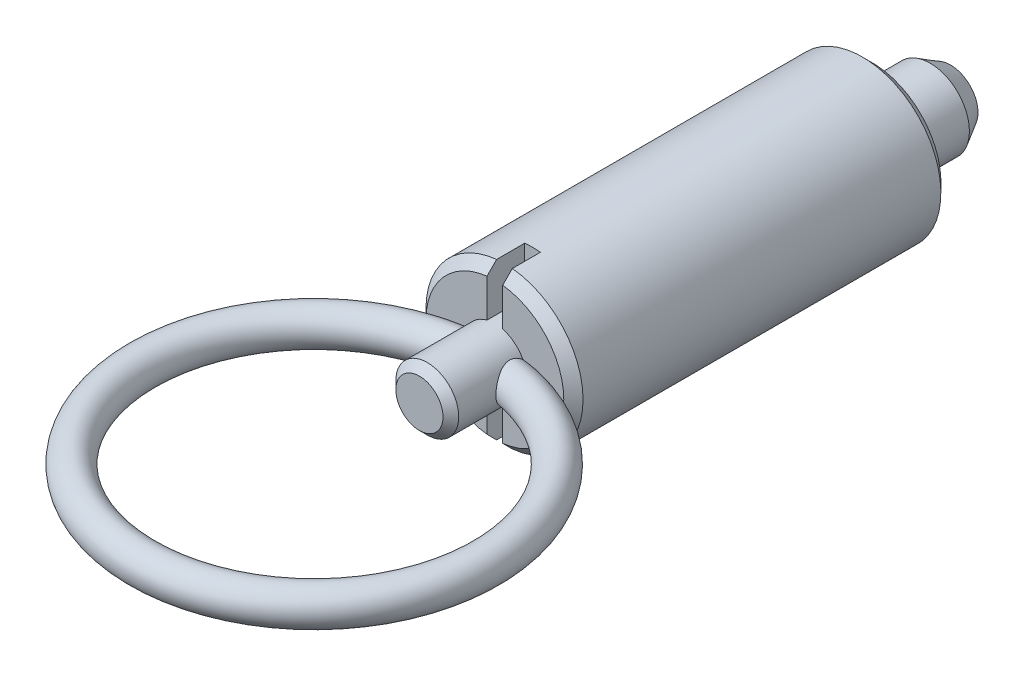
ISO-10303-21;
HEADER;
FILE_DESCRIPTION(('STEP AP214'),'2;1');
FILE_NAME('part.step','',(''),(''),'','','');
FILE_SCHEMA(('AUTOMOTIVE_DESIGN { 1 0 10303 214 1 1 1 1 }'));
ENDSEC;
DATA;
#1=APPLICATION_CONTEXT('core data for automotive mechanical design processes');
#2=APPLICATION_PROTOCOL_DEFINITION('international standard','automotive_design',2000,#1);
#3=PRODUCT_CONTEXT('',#1,'mechanical');
#4=PRODUCT('Part','Part','',(#3));
#5=PRODUCT_RELATED_PRODUCT_CATEGORY('part','',(#4));
#6=PRODUCT_DEFINITION_FORMATION('','',#4);
#7=PRODUCT_DEFINITION_CONTEXT('part definition',#1,'design');
#8=PRODUCT_DEFINITION('design','',#6,#7);
#9=PRODUCT_DEFINITION_SHAPE('','',#8);
#10=(LENGTH_UNIT() NAMED_UNIT(*) SI_UNIT(.MILLI.,.METRE.));
#11=(NAMED_UNIT(*) PLANE_ANGLE_UNIT() SI_UNIT($,.RADIAN.));
#12=(NAMED_UNIT(*) SI_UNIT($,.STERADIAN.) SOLID_ANGLE_UNIT());
#13=UNCERTAINTY_MEASURE_WITH_UNIT(LENGTH_MEASURE(1.E-05),#10,'distance_accuracy_value','');
#14=(GEOMETRIC_REPRESENTATION_CONTEXT(3) GLOBAL_UNCERTAINTY_ASSIGNED_CONTEXT((#13)) GLOBAL_UNIT_ASSIGNED_CONTEXT((#10,
#11,#12)) REPRESENTATION_CONTEXT('',''));
#15=CARTESIAN_POINT('',(0.,0.,0.));
#16=DIRECTION('',(0.,0.,1.));
#17=DIRECTION('',(1.,0.,0.));
#18=AXIS2_PLACEMENT_3D('',#15,#16,#17);
#19=CARTESIAN_POINT('',(1.74944465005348,0.,-5.));
#20=DIRECTION('',(0.,0.,1.));
#21=DIRECTION('',(0.,-1.,0.));
#22=AXIS2_PLACEMENT_3D('',#19,#20,#21);
#23=PLANE('',#22);
#24=CARTESIAN_POINT('',(0.,0.,-5.0000000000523));
#25=DIRECTION('',(0.,0.,1.));
#26=DIRECTION('',(0.,-1.,0.));
#27=AXIS2_PLACEMENT_3D('',#24,#25,#26);
#28=CIRCLE('',#27,1.74944465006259);
#29=CARTESIAN_POINT('',(0.,-1.74944465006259,-5.0000000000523));
#30=VERTEX_POINT('',#29);
#31=EDGE_CURVE('E17',#30,#30,#28,.T.);
#32=ORIENTED_EDGE('',*,*,#31,.F.);
#33=EDGE_LOOP('',(#32));
#34=FACE_BOUND('',#33,.T.);
#35=ADVANCED_FACE('F14',(#34),#23,.F.);
#36=CARTESIAN_POINT('',(0.,0.,-3.70000000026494));
#37=DIRECTION('',(0.,0.,1.));
#38=DIRECTION('',(0.,-1.,0.));
#39=AXIS2_PLACEMENT_3D('',#36,#37,#38);
#40=CONICAL_SURFACE('',#39,2.49999999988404,0.523598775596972);
#41=CARTESIAN_POINT('',(0.,0.,-3.7));
#42=DIRECTION('',(0.,0.,1.));
#43=DIRECTION('',(0.,-1.,0.));
#44=AXIS2_PLACEMENT_3D('',#41,#42,#43);
#45=CIRCLE('',#44,2.5);
#46=CARTESIAN_POINT('',(0.,-2.5,-3.7));
#47=VERTEX_POINT('',#46);
#48=EDGE_CURVE('E174',#47,#47,#45,.T.);
#49=ORIENTED_EDGE('',*,*,#48,.F.);
#50=EDGE_LOOP('',(#49));
#51=FACE_BOUND('',#50,.T.);
#52=ORIENTED_EDGE('',*,*,#31,.T.);
#53=EDGE_LOOP('',(#52));
#54=FACE_BOUND('',#53,.T.);
#55=ADVANCED_FACE('F309',(#51,#54),#40,.T.);
#56=CARTESIAN_POINT('',(0.,0.,-5.));
#57=DIRECTION('',(0.,0.,1.));
#58=DIRECTION('',(0.,-1.,0.));
#59=AXIS2_PLACEMENT_3D('',#56,#57,#58);
#60=CYLINDRICAL_SURFACE('',#59,2.5);
#61=CARTESIAN_POINT('',(0.,0.,0.));
#62=DIRECTION('',(0.,0.,1.));
#63=DIRECTION('',(0.,-1.,0.));
#64=AXIS2_PLACEMENT_3D('',#61,#62,#63);
#65=CIRCLE('',#64,2.5);
#66=CARTESIAN_POINT('',(0.,-2.5,0.));
#67=VERTEX_POINT('',#66);
#68=EDGE_CURVE('E177',#67,#67,#65,.F.);
#69=ORIENTED_EDGE('',*,*,#68,.T.);
#70=EDGE_LOOP('',(#69));
#71=FACE_BOUND('',#70,.T.);
#72=ORIENTED_EDGE('',*,*,#48,.T.);
#73=EDGE_LOOP('',(#72));
#74=FACE_BOUND('',#73,.T.);
#75=ADVANCED_FACE('F306',(#71,#74),#60,.T.);
#76=CARTESIAN_POINT('',(4.3865,0.,0.));
#77=DIRECTION('',(0.,0.,1.));
#78=DIRECTION('',(0.,-1.,0.));
#79=AXIS2_PLACEMENT_3D('',#76,#77,#78);
#80=PLANE('',#79);
#81=CARTESIAN_POINT('',(0.,0.,-5.6843418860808E-11));
#82=DIRECTION('',(0.,0.,1.));
#83=DIRECTION('',(0.,-1.,0.));
#84=AXIS2_PLACEMENT_3D('',#81,#82,#83);
#85=CIRCLE('',#84,4.38649999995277);
#86=CARTESIAN_POINT('',(0.,-4.38649999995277,-5.6843418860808E-11));
#87=VERTEX_POINT('',#86);
#88=EDGE_CURVE('E171',#87,#87,#85,.T.);
#89=ORIENTED_EDGE('',*,*,#88,.F.);
#90=EDGE_LOOP('',(#89));
#91=FACE_BOUND('',#90,.T.);
#92=ORIENTED_EDGE('',*,*,#68,.F.);
#93=EDGE_LOOP('',(#92));
#94=FACE_BOUND('',#93,.T.);
#95=ADVANCED_FACE('F302',(#91,#94),#80,.F.);
#96=CARTESIAN_POINT('',(0.,0.,0.61349999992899));
#97=DIRECTION('',(0.,0.,1.));
#98=DIRECTION('',(0.,-1.,0.));
#99=AXIS2_PLACEMENT_3D('',#96,#97,#98);
#100=CONICAL_SURFACE('',#99,4.99999999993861,0.785398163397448);
#101=CARTESIAN_POINT('',(0.,0.,0.6135));
#102=DIRECTION('',(0.,0.,1.));
#103=DIRECTION('',(0.,-1.,0.));
#104=AXIS2_PLACEMENT_3D('',#101,#102,#103);
#105=CIRCLE('',#104,5.);
#106=CARTESIAN_POINT('',(0.,-5.,0.6135));
#107=VERTEX_POINT('',#106);
#108=EDGE_CURVE('E109',#107,#107,#105,.T.);
#109=ORIENTED_EDGE('',*,*,#108,.F.);
#110=EDGE_LOOP('',(#109));
#111=FACE_BOUND('',#110,.T.);
#112=ORIENTED_EDGE('',*,*,#88,.T.);
#113=EDGE_LOOP('',(#112));
#114=FACE_BOUND('',#113,.T.);
#115=ADVANCED_FACE('F298',(#111,#114),#100,.T.);
#116=CARTESIAN_POINT('',(0.,0.,28.8));
#117=DIRECTION('',(0.,0.,-1.));
#118=DIRECTION('',(0.,1.,0.));
#119=AXIS2_PLACEMENT_3D('',#116,#117,#118);
#120=PLANE('',#119);
#121=CARTESIAN_POINT('',(0.,0.,28.8000000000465));
#122=DIRECTION('',(0.,0.,-1.));
#123=DIRECTION('',(0.,1.,0.));
#124=AXIS2_PLACEMENT_3D('',#121,#122,#123);
#125=CIRCLE('',#124,1.50000000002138);
#126=CARTESIAN_POINT('',(0.,1.50000000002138,28.8000000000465));
#127=VERTEX_POINT('',#126);
#128=EDGE_CURVE('E119',#127,#127,#125,.T.);
#129=ORIENTED_EDGE('',*,*,#128,.F.);
#130=EDGE_LOOP('',(#129));
#131=FACE_BOUND('',#130,.T.);
#132=ADVANCED_FACE('F258',(#131),#120,.F.);
#133=CARTESIAN_POINT('',(0.,0.,28.3000000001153));
#134=DIRECTION('',(0.,0.,-1.));
#135=DIRECTION('',(0.,1.,0.));
#136=AXIS2_PLACEMENT_3D('',#133,#134,#135);
#137=CONICAL_SURFACE('',#136,1.9999999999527,0.785398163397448);
#138=ORIENTED_EDGE('',*,*,#128,.T.);
#139=EDGE_LOOP('',(#138));
#140=FACE_BOUND('',#139,.T.);
#141=CARTESIAN_POINT('',(0.,0.,28.3));
#142=DIRECTION('',(0.,0.,1.));
#143=DIRECTION('',(0.,-1.,0.));
#144=AXIS2_PLACEMENT_3D('',#141,#142,#143);
#145=CIRCLE('',#144,2.);
#146=CARTESIAN_POINT('',(0.,-2.,28.3));
#147=VERTEX_POINT('',#146);
#148=EDGE_CURVE('E137',#147,#147,#145,.F.);
#149=ORIENTED_EDGE('',*,*,#148,.F.);
#150=EDGE_LOOP('',(#149));
#151=FACE_BOUND('',#150,.T.);
#152=ADVANCED_FACE('F255',(#140,#151),#137,.T.);
#153=CARTESIAN_POINT('',(0.,0.,35.5));
#154=DIRECTION('',(0.,-1.,0.));
#155=DIRECTION('',(1.,0.,0.));
#156=AXIS2_PLACEMENT_3D('',#153,#154,#155);
#157=TOROIDAL_SURFACE('',#156,10.925,1.15);
#158=CARTESIAN_POINT('',(1.78476912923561,0.902551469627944,24.));
#159=CARTESIAN_POINT('',(1.766631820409,0.938435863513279,24.0431175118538));
#160=CARTESIAN_POINT('',(1.74879786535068,0.970988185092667,24.0892748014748));
#161=CARTESIAN_POINT('',(1.71545124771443,1.02875631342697,24.1870412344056));
#162=CARTESIAN_POINT('',(1.69995018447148,1.05393601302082,24.238675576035));
#163=CARTESIAN_POINT('',(1.67313310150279,1.0960196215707,24.3465793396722));
#164=CARTESIAN_POINT('',(1.66183629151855,1.11288565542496,24.4028686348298));
#165=CARTESIAN_POINT('',(1.6451157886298,1.13746273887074,24.5180886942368));
#166=CARTESIAN_POINT('',(1.63967356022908,1.14520268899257,24.5770105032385));
#167=CARTESIAN_POINT('',(1.6354310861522,1.15124898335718,24.6905839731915));
#168=CARTESIAN_POINT('',(1.63611280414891,1.15029102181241,24.7451800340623));
#169=CARTESIAN_POINT('',(1.64254496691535,1.14108481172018,24.8534961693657));
#170=CARTESIAN_POINT('',(1.64830354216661,1.13282486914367,24.9072146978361));
#171=CARTESIAN_POINT('',(1.6660547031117,1.10660417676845,25.02645972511));
#172=CARTESIAN_POINT('',(1.67929154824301,1.08665838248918,25.0913604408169));
#173=CARTESIAN_POINT('',(1.71010159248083,1.03749182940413,25.2164292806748));
#174=CARTESIAN_POINT('',(1.72768068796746,1.0082584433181,25.2765908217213));
#175=CARTESIAN_POINT('',(1.76527077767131,0.940918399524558,25.3922228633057));
#176=CARTESIAN_POINT('',(1.78531454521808,0.90268416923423,25.4476086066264));
#177=CARTESIAN_POINT('',(1.81550576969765,0.839337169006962,25.5256509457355));
#178=CARTESIAN_POINT('',(1.8255886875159,0.817226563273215,25.5508217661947));
#179=CARTESIAN_POINT('',(1.84558579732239,0.771004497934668,25.5993988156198));
#180=CARTESIAN_POINT('',(1.8554997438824,0.746890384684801,25.6228026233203));
#181=CARTESIAN_POINT('',(1.88307268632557,0.675637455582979,25.6864889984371));
#182=CARTESIAN_POINT('',(1.90024401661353,0.626169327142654,25.7244404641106));
#183=CARTESIAN_POINT('',(1.93167740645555,0.521165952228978,25.7922035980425));
#184=CARTESIAN_POINT('',(1.94594447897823,0.465641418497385,25.8220293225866));
#185=CARTESIAN_POINT('',(1.96810100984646,0.359190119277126,25.8676868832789));
#186=CARTESIAN_POINT('',(1.97665879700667,0.309054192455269,25.8850267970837));
#187=CARTESIAN_POINT('',(1.99000988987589,0.206251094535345,25.911910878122));
#188=CARTESIAN_POINT('',(1.99480604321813,0.153585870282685,25.9214609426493));
#189=CARTESIAN_POINT('',(2.0001616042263,0.0469970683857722,25.9321177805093));
#190=CARTESIAN_POINT('',(2.00070650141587,-0.00693018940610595,25.9331956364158));
#191=CARTESIAN_POINT('',(1.99746095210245,-0.114135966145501,25.9267458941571));
#192=CARTESIAN_POINT('',(1.99366974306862,-0.167414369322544,25.919216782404));
#193=CARTESIAN_POINT('',(1.98244855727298,-0.269037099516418,25.8967096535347));
#194=CARTESIAN_POINT('',(1.97521507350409,-0.317494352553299,25.8821332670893));
#195=CARTESIAN_POINT('',(1.95779777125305,-0.411484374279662,25.8465284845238));
#196=CARTESIAN_POINT('',(1.94760839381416,-0.457011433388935,25.8254879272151));
#197=CARTESIAN_POINT('',(1.92368482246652,-0.549525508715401,25.7750835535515));
#198=CARTESIAN_POINT('',(1.90967618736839,-0.596066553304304,25.7450363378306));
#199=CARTESIAN_POINT('',(1.87992172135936,-0.684147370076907,25.6791690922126));
#200=CARTESIAN_POINT('',(1.86417667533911,-0.725689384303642,25.6433516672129));
#201=CARTESIAN_POINT('',(1.82848395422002,-0.811951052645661,25.5585671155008));
#202=CARTESIAN_POINT('',(1.80835814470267,-0.855447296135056,25.5084263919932));
#203=CARTESIAN_POINT('',(1.76880091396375,-0.934506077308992,25.4018843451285));
#204=CARTESIAN_POINT('',(1.74937088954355,-0.970053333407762,25.3454712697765));
#205=CARTESIAN_POINT('',(1.71070743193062,-1.03690546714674,25.2188541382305));
#206=CARTESIAN_POINT('',(1.69187881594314,-1.06692859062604,25.1478238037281));
#207=CARTESIAN_POINT('',(1.66889688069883,-1.10226136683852,25.0372460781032));
#208=CARTESIAN_POINT('',(1.66211623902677,-1.11241791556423,24.9997449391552));
#209=CARTESIAN_POINT('',(1.65071524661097,-1.1292661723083,24.9236611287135));
#210=CARTESIAN_POINT('',(1.64609361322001,-1.13595993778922,24.8850791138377));
#211=CARTESIAN_POINT('',(1.63811547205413,-1.14745411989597,24.7924559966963));
#212=CARTESIAN_POINT('',(1.63589923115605,-1.1505799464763,24.7380889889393));
#213=CARTESIAN_POINT('',(1.63683877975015,-1.14924307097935,24.6295426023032));
#214=CARTESIAN_POINT('',(1.63998868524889,-1.1447886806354,24.5753630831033));
#215=CARTESIAN_POINT('',(1.65141528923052,-1.1282401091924,24.4687753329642));
#216=CARTESIAN_POINT('',(1.65968967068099,-1.11614938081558,24.4163663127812));
#217=CARTESIAN_POINT('',(1.68043360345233,-1.08466330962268,24.3145828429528));
#218=CARTESIAN_POINT('',(1.69291081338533,-1.06525462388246,24.2652141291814));
#219=CARTESIAN_POINT('',(1.71839402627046,-1.02352974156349,24.1784427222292));
#220=CARTESIAN_POINT('',(1.7309688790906,-1.00223011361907,24.1404136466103));
#221=CARTESIAN_POINT('',(1.75722842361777,-0.955441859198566,24.0676896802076));
#222=CARTESIAN_POINT('',(1.77090804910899,-0.929971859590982,24.0329810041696));
#223=CARTESIAN_POINT('',(1.78476912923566,-0.902551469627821,24.));
#224=B_SPLINE_CURVE_WITH_KNOTS('',3,(#158,#159,#160,#161,#162,#163,#164,#165,#166,#167,#168,
#169,#170,#171,#172,#173,#174,#175,#176,#177,#178,#179,#180,#181,#182,#183,#184,#185,#186,#187,
#188,#189,#190,#191,#192,#193,#194,#195,#196,#197,#198,#199,#200,#201,#202,#203,#204,#205,#206,
#207,#208,#209,#210,#211,#212,#213,#214,#215,#216,#217,#218,#219,#220,#221,#222,#223),
.UNSPECIFIED.,.F.,.F.,(4,2,2,2,2,2,2,2,2,2,2,2,2,2,2,2,2,2,2,2,2,2,2,2,2,2,2,2,2,2,2,2,4),(0.,
0.176862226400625,0.354576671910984,0.533093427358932,0.711043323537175,0.874091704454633,
1.03740167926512,1.24381681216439,1.45051379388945,1.66033841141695,1.76521449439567,
1.87023177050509,2.06344264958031,2.25631715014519,2.41684175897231,2.5772447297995,
2.73819495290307,2.89917348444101,3.05189993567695,3.20491549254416,3.37572641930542,
3.5464604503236,3.75374287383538,3.96142042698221,4.19804235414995,4.31617322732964,
4.43423383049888,4.59696329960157,4.75951445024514,4.92199215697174,5.08476755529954,
5.22053797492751,5.35571774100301),.UNSPECIFIED.);
#225=CARTESIAN_POINT('',(1.78476912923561,0.902551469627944,24.));
#226=VERTEX_POINT('',#225);
#227=CARTESIAN_POINT('',(1.7847691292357,-0.902551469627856,24.));
#228=VERTEX_POINT('',#227);
#229=EDGE_CURVE('E23',#226,#228,#224,.T.);
#230=ORIENTED_EDGE('',*,*,#229,.T.);
#231=CARTESIAN_POINT('',(1.78476912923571,-0.902551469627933,24.));
#232=CARTESIAN_POINT('',(1.83794840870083,-0.896107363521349,24.));
#233=CARTESIAN_POINT('',(1.89107637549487,-0.889217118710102,24.));
#234=CARTESIAN_POINT('',(1.99726292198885,-0.874402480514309,24.));
#235=CARTESIAN_POINT('',(2.05032130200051,-0.866476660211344,24.));
#236=CARTESIAN_POINT('',(2.15628126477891,-0.849461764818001,24.));
#237=CARTESIAN_POINT('',(2.20918275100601,-0.840372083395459,24.));
#238=CARTESIAN_POINT('',(2.3152791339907,-0.820765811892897,24.));
#239=CARTESIAN_POINT('',(2.3684715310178,-0.810235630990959,24.0000000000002));
#240=CARTESIAN_POINT('',(2.47450459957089,-0.78761595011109,23.9999999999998));
#241=CARTESIAN_POINT('',(2.5273454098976,-0.775527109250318,23.9999999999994));
#242=CARTESIAN_POINT('',(2.63255461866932,-0.749524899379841,24.0000000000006));
#243=CARTESIAN_POINT('',(2.6849231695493,-0.735612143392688,24.0000000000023));
#244=CARTESIAN_POINT('',(2.81840562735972,-0.697188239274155,24.0000000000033));
#245=CARTESIAN_POINT('',(2.89909364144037,-0.671121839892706,24.0000000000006));
#246=CARTESIAN_POINT('',(3.01811329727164,-0.626713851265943,23.9999999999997));
#247=CARTESIAN_POINT('',(3.05743687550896,-0.611033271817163,23.9999999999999));
#248=CARTESIAN_POINT('',(3.13516069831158,-0.577558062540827,24.0000000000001));
#249=CARTESIAN_POINT('',(3.17356122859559,-0.559764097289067,24.));
#250=CARTESIAN_POINT('',(3.26067067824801,-0.515795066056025,24.));
#251=CARTESIAN_POINT('',(3.30894379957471,-0.488720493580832,24.));
#252=CARTESIAN_POINT('',(3.37858743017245,-0.44387718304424,24.));
#253=CARTESIAN_POINT('',(3.40132751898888,-0.428235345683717,24.));
#254=CARTESIAN_POINT('',(3.44558357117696,-0.395310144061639,24.));
#255=CARTESIAN_POINT('',(3.46710011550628,-0.378027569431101,24.));
#256=CARTESIAN_POINT('',(3.51083098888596,-0.339498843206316,24.));
#257=CARTESIAN_POINT('',(3.53284824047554,-0.318025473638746,24.));
#258=CARTESIAN_POINT('',(3.57391569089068,-0.272372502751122,24.));
#259=CARTESIAN_POINT('',(3.59296872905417,-0.248195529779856,24.));
#260=CARTESIAN_POINT('',(3.622991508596,-0.202611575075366,24.));
#261=CARTESIAN_POINT('',(3.63481698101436,-0.18177574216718,24.));
#262=CARTESIAN_POINT('',(3.65495492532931,-0.138485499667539,24.));
#263=CARTESIAN_POINT('',(3.66327616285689,-0.116035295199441,24.));
#264=CARTESIAN_POINT('',(3.6746197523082,-0.0735351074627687,24.));
#265=CARTESIAN_POINT('',(3.67826376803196,-0.0536528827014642,24.));
#266=CARTESIAN_POINT('',(3.68210703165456,-0.0135586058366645,24.));
#267=CARTESIAN_POINT('',(3.6823081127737,0.00665326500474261,24.));
#268=CARTESIAN_POINT('',(3.67924816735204,0.0467860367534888,24.));
#269=CARTESIAN_POINT('',(3.67599066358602,0.0667072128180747,24.));
#270=CARTESIAN_POINT('',(3.66633453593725,0.105771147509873,24.));
#271=CARTESIAN_POINT('',(3.65993301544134,0.124913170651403,24.));
#272=CARTESIAN_POINT('',(3.64145447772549,0.169385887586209,24.));
#273=CARTESIAN_POINT('',(3.62813607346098,0.194197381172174,24.));
#274=CARTESIAN_POINT('',(3.59773723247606,0.24145068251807,24.));
#275=CARTESIAN_POINT('',(3.58064119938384,0.263882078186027,24.));
#276=CARTESIAN_POINT('',(3.53105836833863,0.32121477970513,24.));
#277=CARTESIAN_POINT('',(3.49612144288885,0.353973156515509,24.));
#278=CARTESIAN_POINT('',(3.42203364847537,0.414198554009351,24.));
#279=CARTESIAN_POINT('',(3.38287338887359,0.44165338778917,24.));
#280=CARTESIAN_POINT('',(3.28789165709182,0.501306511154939,24.));
#281=CARTESIAN_POINT('',(3.23102392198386,0.531817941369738,24.));
#282=CARTESIAN_POINT('',(3.11478733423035,0.587311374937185,24.));
#283=CARTESIAN_POINT('',(3.0554197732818,0.612296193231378,24.));
#284=CARTESIAN_POINT('',(2.93464443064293,0.658238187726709,24.));
#285=CARTESIAN_POINT('',(2.87322446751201,0.679162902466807,24.));
#286=CARTESIAN_POINT('',(2.74933736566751,0.717646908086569,24.));
#287=CARTESIAN_POINT('',(2.68686993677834,0.735205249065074,24.));
#288=CARTESIAN_POINT('',(2.57760554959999,0.763365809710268,24.));
#289=CARTESIAN_POINT('',(2.53096591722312,0.774588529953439,24.));
#290=CARTESIAN_POINT('',(2.43739208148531,0.795732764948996,24.));
#291=CARTESIAN_POINT('',(2.39045786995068,0.805654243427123,24.));
#292=CARTESIAN_POINT('',(2.29635688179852,0.824358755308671,24.));
#293=CARTESIAN_POINT('',(2.24919006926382,0.833141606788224,24.));
#294=CARTESIAN_POINT('',(2.15576950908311,0.849508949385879,24.));
#295=CARTESIAN_POINT('',(2.10951976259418,0.857116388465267,24.));
#296=CARTESIAN_POINT('',(2.01689816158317,0.871472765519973,24.));
#297=CARTESIAN_POINT('',(1.97052633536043,0.878221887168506,24.));
#298=CARTESIAN_POINT('',(1.87770597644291,0.890944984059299,24.));
#299=CARTESIAN_POINT('',(1.8312575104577,0.89691944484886,24.));
#300=CARTESIAN_POINT('',(1.78476912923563,0.902551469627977,24.));
#301=B_SPLINE_CURVE_WITH_KNOTS('',3,(#231,#232,#233,#234,#235,#236,#237,#238,#239,#240,#241,
#242,#243,#244,#245,#246,#247,#248,#249,#250,#251,#252,#253,#254,#255,#256,#257,#258,#259,#260,
#261,#262,#263,#264,#265,#266,#267,#268,#269,#270,#271,#272,#273,#274,#275,#276,#277,#278,#279,
#280,#281,#282,#283,#284,#285,#286,#287,#288,#289,#290,#291,#292,#293,#294,#295,#296,#297,#298,
#299,#300),.UNSPECIFIED.,.F.,.F.,(4,2,2,2,2,2,2,2,2,2,2,2,2,2,2,2,2,2,2,2,2,2,2,2,2,2,2,2,2,2,2,
2,2,2,4),(0.,0.160707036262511,0.321637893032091,0.482652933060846,0.645307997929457,
0.80789450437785,0.970426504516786,1.2245194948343,1.35147162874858,1.4783839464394,
1.64407839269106,1.72682150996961,1.809525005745,1.90159744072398,1.99358113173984,
2.06520752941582,2.13665367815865,2.19701899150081,2.25735216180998,2.31762393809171,
2.37795134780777,2.46195252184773,2.54630720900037,2.68917366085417,2.83236459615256,
3.02551227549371,3.21856134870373,3.4130954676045,3.60768439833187,3.75157797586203,
3.89547556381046,4.03939611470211,4.18000072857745,4.32057520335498,4.4610611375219),.UNSPECIFIED.);
#302=EDGE_CURVE('E9',#228,#226,#301,.T.);
#303=ORIENTED_EDGE('',*,*,#302,.T.);
#304=EDGE_LOOP('',(#230,#303));
#305=FACE_BOUND('',#304,.T.);
#306=CARTESIAN_POINT('',(-1.78476912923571,0.902551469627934,24.));
#307=CARTESIAN_POINT('',(-1.83794840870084,0.896107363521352,24.));
#308=CARTESIAN_POINT('',(-1.89107637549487,0.889217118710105,24.));
#309=CARTESIAN_POINT('',(-1.99726292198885,0.874402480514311,24.));
#310=CARTESIAN_POINT('',(-2.05032130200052,0.866476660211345,24.));
#311=CARTESIAN_POINT('',(-2.15628126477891,0.849461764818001,24.));
#312=CARTESIAN_POINT('',(-2.20918275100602,0.84037208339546,24.));
#313=CARTESIAN_POINT('',(-2.3152791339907,0.820765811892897,24.));
#314=CARTESIAN_POINT('',(-2.3684715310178,0.810235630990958,24.0000000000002));
#315=CARTESIAN_POINT('',(-2.4745045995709,0.787615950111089,23.9999999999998));
#316=CARTESIAN_POINT('',(-2.52734540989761,0.775527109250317,23.9999999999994));
#317=CARTESIAN_POINT('',(-2.63255461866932,0.74952489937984,24.0000000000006));
#318=CARTESIAN_POINT('',(-2.68492316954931,0.735612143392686,24.0000000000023));
#319=CARTESIAN_POINT('',(-2.81840562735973,0.697188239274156,24.0000000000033));
#320=CARTESIAN_POINT('',(-2.89909364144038,0.671121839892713,24.0000000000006));
#321=CARTESIAN_POINT('',(-3.01811329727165,0.626713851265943,23.9999999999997));
#322=CARTESIAN_POINT('',(-3.05743687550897,0.611033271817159,23.9999999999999));
#323=CARTESIAN_POINT('',(-3.13516069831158,0.577558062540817,24.0000000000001));
#324=CARTESIAN_POINT('',(-3.1735612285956,0.559764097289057,24.));
#325=CARTESIAN_POINT('',(-3.26067067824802,0.515795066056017,24.));
#326=CARTESIAN_POINT('',(-3.30894379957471,0.488720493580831,24.));
#327=CARTESIAN_POINT('',(-3.37858743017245,0.443877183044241,24.));
#328=CARTESIAN_POINT('',(-3.40132751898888,0.428235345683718,24.));
#329=CARTESIAN_POINT('',(-3.44558357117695,0.395310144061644,24.));
#330=CARTESIAN_POINT('',(-3.46710011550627,0.37802756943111,24.));
#331=CARTESIAN_POINT('',(-3.51083098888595,0.339498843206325,24.));
#332=CARTESIAN_POINT('',(-3.53284824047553,0.31802547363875,24.));
#333=CARTESIAN_POINT('',(-3.57391569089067,0.272372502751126,24.));
#334=CARTESIAN_POINT('',(-3.59296872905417,0.248195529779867,24.));
#335=CARTESIAN_POINT('',(-3.622991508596,0.202611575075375,24.));
#336=CARTESIAN_POINT('',(-3.63481698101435,0.181775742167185,24.));
#337=CARTESIAN_POINT('',(-3.6549549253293,0.138485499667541,24.));
#338=CARTESIAN_POINT('',(-3.66327616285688,0.116035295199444,24.));
#339=CARTESIAN_POINT('',(-3.6746197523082,0.0735351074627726,24.));
#340=CARTESIAN_POINT('',(-3.67826376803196,0.0536528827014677,24.));
#341=CARTESIAN_POINT('',(-3.68210703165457,0.0135586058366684,24.));
#342=CARTESIAN_POINT('',(-3.6823081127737,-0.00665326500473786,24.));
#343=CARTESIAN_POINT('',(-3.67924816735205,-0.0467860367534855,24.));
#344=CARTESIAN_POINT('',(-3.67599066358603,-0.0667072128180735,24.));
#345=CARTESIAN_POINT('',(-3.66633453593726,-0.105771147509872,24.));
#346=CARTESIAN_POINT('',(-3.65993301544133,-0.1249131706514,24.));
#347=CARTESIAN_POINT('',(-3.64145447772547,-0.169385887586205,24.));
#348=CARTESIAN_POINT('',(-3.62813607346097,-0.194197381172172,24.));
#349=CARTESIAN_POINT('',(-3.59773723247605,-0.241450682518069,24.));
#350=CARTESIAN_POINT('',(-3.58064119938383,-0.263882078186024,24.));
#351=CARTESIAN_POINT('',(-3.53105836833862,-0.321214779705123,24.));
#352=CARTESIAN_POINT('',(-3.49612144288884,-0.3539731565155,24.));
#353=CARTESIAN_POINT('',(-3.42203364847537,-0.414198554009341,24.));
#354=CARTESIAN_POINT('',(-3.38287338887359,-0.441653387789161,24.));
#355=CARTESIAN_POINT('',(-3.28789165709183,-0.501306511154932,24.));
#356=CARTESIAN_POINT('',(-3.23102392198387,-0.53181794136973,24.));
#357=CARTESIAN_POINT('',(-3.11478733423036,-0.587311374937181,24.));
#358=CARTESIAN_POINT('',(-3.05541977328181,-0.612296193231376,24.));
#359=CARTESIAN_POINT('',(-2.93464443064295,-0.658238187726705,24.));
#360=CARTESIAN_POINT('',(-2.87322446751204,-0.6791629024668,24.));
#361=CARTESIAN_POINT('',(-2.74933736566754,-0.717646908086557,24.));
#362=CARTESIAN_POINT('',(-2.68686993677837,-0.73520524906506,24.));
#363=CARTESIAN_POINT('',(-2.57760554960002,-0.763365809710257,24.));
#364=CARTESIAN_POINT('',(-2.53096591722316,-0.774588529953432,24.));
#365=CARTESIAN_POINT('',(-2.43739208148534,-0.795732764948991,24.));
#366=CARTESIAN_POINT('',(-2.3904578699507,-0.805654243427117,24.));
#367=CARTESIAN_POINT('',(-2.29635688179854,-0.824358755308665,24.));
#368=CARTESIAN_POINT('',(-2.24919006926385,-0.833141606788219,24.));
#369=CARTESIAN_POINT('',(-2.15576950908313,-0.849508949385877,24.));
#370=CARTESIAN_POINT('',(-2.1095197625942,-0.857116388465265,24.));
#371=CARTESIAN_POINT('',(-2.01689816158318,-0.871472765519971,24.));
#372=CARTESIAN_POINT('',(-1.97052633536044,-0.878221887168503,24.));
#373=CARTESIAN_POINT('',(-1.87770597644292,-0.890944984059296,24.));
#374=CARTESIAN_POINT('',(-1.83125751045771,-0.896919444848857,24.));
#375=CARTESIAN_POINT('',(-1.78476912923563,-0.902551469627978,24.));
#376=B_SPLINE_CURVE_WITH_KNOTS('',3,(#306,#307,#308,#309,#310,#311,#312,#313,#314,#315,#316,
#317,#318,#319,#320,#321,#322,#323,#324,#325,#326,#327,#328,#329,#330,#331,#332,#333,#334,#335,
#336,#337,#338,#339,#340,#341,#342,#343,#344,#345,#346,#347,#348,#349,#350,#351,#352,#353,#354,
#355,#356,#357,#358,#359,#360,#361,#362,#363,#364,#365,#366,#367,#368,#369,#370,#371,#372,#373,
#374,#375),.UNSPECIFIED.,.F.,.F.,(4,2,2,2,2,2,2,2,2,2,2,2,2,2,2,2,2,2,2,2,2,2,2,2,2,2,2,2,2,2,2,
2,2,2,4),(0.,0.160707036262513,0.321637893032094,0.48265293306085,0.645307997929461,
0.807894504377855,0.970426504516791,1.2245194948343,1.35147162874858,1.47838394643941,
1.64407839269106,1.72682150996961,1.80952500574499,1.90159744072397,1.99358113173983,
2.06520752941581,2.13665367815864,2.19701899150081,2.25735216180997,2.31762393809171,
2.37795134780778,2.46195252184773,2.54630720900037,2.68917366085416,2.83236459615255,
3.02551227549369,3.2185613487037,3.41309546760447,3.60768439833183,3.751577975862,
3.89547556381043,4.03939611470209,4.18000072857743,4.32057520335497,4.46106113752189),.UNSPECIFIED.);
#377=CARTESIAN_POINT('',(-1.7847691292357,0.902551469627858,24.));
#378=VERTEX_POINT('',#377);
#379=CARTESIAN_POINT('',(-1.78476912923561,-0.902551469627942,24.));
#380=VERTEX_POINT('',#379);
#381=EDGE_CURVE('E214',#378,#380,#376,.T.);
#382=ORIENTED_EDGE('',*,*,#381,.T.);
#383=CARTESIAN_POINT('',(-1.7847691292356,-0.902551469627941,24.));
#384=CARTESIAN_POINT('',(-1.76663182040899,-0.938435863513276,24.0431175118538));
#385=CARTESIAN_POINT('',(-1.74879786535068,-0.970988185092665,24.0892748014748));
#386=CARTESIAN_POINT('',(-1.71545124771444,-1.02875631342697,24.1870412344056));
#387=CARTESIAN_POINT('',(-1.69995018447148,-1.05393601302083,24.238675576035));
#388=CARTESIAN_POINT('',(-1.6731331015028,-1.0960196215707,24.3465793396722));
#389=CARTESIAN_POINT('',(-1.66183629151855,-1.11288565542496,24.4028686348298));
#390=CARTESIAN_POINT('',(-1.6451157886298,-1.13746273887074,24.5180886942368));
#391=CARTESIAN_POINT('',(-1.63967356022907,-1.14520268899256,24.5770105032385));
#392=CARTESIAN_POINT('',(-1.63543108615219,-1.15124898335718,24.6905839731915));
#393=CARTESIAN_POINT('',(-1.63611280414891,-1.15029102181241,24.7451800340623));
#394=CARTESIAN_POINT('',(-1.64254496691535,-1.14108481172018,24.8534961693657));
#395=CARTESIAN_POINT('',(-1.6483035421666,-1.13282486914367,24.9072146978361));
#396=CARTESIAN_POINT('',(-1.66605470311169,-1.10660417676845,25.02645972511));
#397=CARTESIAN_POINT('',(-1.67929154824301,-1.08665838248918,25.0913604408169));
#398=CARTESIAN_POINT('',(-1.71010159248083,-1.03749182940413,25.2164292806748));
#399=CARTESIAN_POINT('',(-1.72768068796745,-1.0082584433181,25.2765908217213));
#400=CARTESIAN_POINT('',(-1.7652707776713,-0.940918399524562,25.3922228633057));
#401=CARTESIAN_POINT('',(-1.78531454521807,-0.902684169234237,25.4476086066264));
#402=CARTESIAN_POINT('',(-1.81550576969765,-0.839337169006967,25.5256509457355));
#403=CARTESIAN_POINT('',(-1.8255886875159,-0.817226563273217,25.5508217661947));
#404=CARTESIAN_POINT('',(-1.84558579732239,-0.771004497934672,25.5993988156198));
#405=CARTESIAN_POINT('',(-1.85549974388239,-0.746890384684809,25.6228026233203));
#406=CARTESIAN_POINT('',(-1.88307268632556,-0.675637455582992,25.6864889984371));
#407=CARTESIAN_POINT('',(-1.90024401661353,-0.626169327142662,25.7244404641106));
#408=CARTESIAN_POINT('',(-1.93167740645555,-0.521165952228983,25.7922035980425));
#409=CARTESIAN_POINT('',(-1.94594447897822,-0.465641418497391,25.8220293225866));
#410=CARTESIAN_POINT('',(-1.96810100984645,-0.359190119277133,25.8676868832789));
#411=CARTESIAN_POINT('',(-1.97665879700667,-0.309054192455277,25.8850267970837));
#412=CARTESIAN_POINT('',(-1.99000988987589,-0.206251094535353,25.911910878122));
#413=CARTESIAN_POINT('',(-1.99480604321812,-0.153585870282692,25.9214609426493));
#414=CARTESIAN_POINT('',(-2.00016160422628,-0.046997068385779,25.9321177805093));
#415=CARTESIAN_POINT('',(-2.00070650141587,0.00693018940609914,25.9331956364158));
#416=CARTESIAN_POINT('',(-1.99746095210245,0.114135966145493,25.9267458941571));
#417=CARTESIAN_POINT('',(-1.99366974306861,0.167414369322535,25.919216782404));
#418=CARTESIAN_POINT('',(-1.98244855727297,0.269037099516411,25.8967096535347));
#419=CARTESIAN_POINT('',(-1.97521507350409,0.317494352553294,25.8821332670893));
#420=CARTESIAN_POINT('',(-1.95779777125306,0.411484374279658,25.8465284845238));
#421=CARTESIAN_POINT('',(-1.94760839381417,0.45701143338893,25.8254879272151));
#422=CARTESIAN_POINT('',(-1.92368482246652,0.549525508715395,25.7750835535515));
#423=CARTESIAN_POINT('',(-1.90967618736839,0.596066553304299,25.7450363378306));
#424=CARTESIAN_POINT('',(-1.87992172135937,0.684147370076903,25.6791690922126));
#425=CARTESIAN_POINT('',(-1.86417667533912,0.725689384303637,25.6433516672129));
#426=CARTESIAN_POINT('',(-1.82848395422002,0.811951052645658,25.5585671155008));
#427=CARTESIAN_POINT('',(-1.80835814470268,0.855447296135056,25.5084263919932));
#428=CARTESIAN_POINT('',(-1.76880091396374,0.934506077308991,25.4018843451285));
#429=CARTESIAN_POINT('',(-1.74937088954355,0.970053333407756,25.3454712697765));
#430=CARTESIAN_POINT('',(-1.71070743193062,1.03690546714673,25.2188541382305));
#431=CARTESIAN_POINT('',(-1.69187881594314,1.06692859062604,25.1478238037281));
#432=CARTESIAN_POINT('',(-1.66889688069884,1.10226136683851,25.0372460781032));
#433=CARTESIAN_POINT('',(-1.66211623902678,1.11241791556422,24.9997449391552));
#434=CARTESIAN_POINT('',(-1.65071524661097,1.1292661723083,24.9236611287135));
#435=CARTESIAN_POINT('',(-1.64609361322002,1.13595993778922,24.8850791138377));
#436=CARTESIAN_POINT('',(-1.63811547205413,1.14745411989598,24.7924559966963));
#437=CARTESIAN_POINT('',(-1.63589923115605,1.15057994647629,24.7380889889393));
#438=CARTESIAN_POINT('',(-1.63683877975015,1.14924307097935,24.6295426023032));
#439=CARTESIAN_POINT('',(-1.6399886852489,1.1447886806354,24.5753630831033));
#440=CARTESIAN_POINT('',(-1.65141528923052,1.1282401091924,24.4687753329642));
#441=CARTESIAN_POINT('',(-1.65968967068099,1.11614938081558,24.4163663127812));
#442=CARTESIAN_POINT('',(-1.68043360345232,1.08466330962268,24.3145828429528));
#443=CARTESIAN_POINT('',(-1.69291081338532,1.06525462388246,24.2652141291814));
#444=CARTESIAN_POINT('',(-1.71839402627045,1.02352974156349,24.1784427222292));
#445=CARTESIAN_POINT('',(-1.7309688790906,1.00223011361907,24.1404136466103));
#446=CARTESIAN_POINT('',(-1.75722842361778,0.955441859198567,24.0676896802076));
#447=CARTESIAN_POINT('',(-1.770908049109,0.929971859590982,24.0329810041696));
#448=CARTESIAN_POINT('',(-1.78476912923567,0.902551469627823,24.));
#449=B_SPLINE_CURVE_WITH_KNOTS('',3,(#383,#384,#385,#386,#387,#388,#389,#390,#391,#392,#393,
#394,#395,#396,#397,#398,#399,#400,#401,#402,#403,#404,#405,#406,#407,#408,#409,#410,#411,#412,
#413,#414,#415,#416,#417,#418,#419,#420,#421,#422,#423,#424,#425,#426,#427,#428,#429,#430,#431,
#432,#433,#434,#435,#436,#437,#438,#439,#440,#441,#442,#443,#444,#445,#446,#447,#448),
.UNSPECIFIED.,.F.,.F.,(4,2,2,2,2,2,2,2,2,2,2,2,2,2,2,2,2,2,2,2,2,2,2,2,2,2,2,2,2,2,2,2,4),(0.,
0.176862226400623,0.354576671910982,0.53309342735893,0.711043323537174,0.874091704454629,
1.03740167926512,1.24381681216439,1.45051379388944,1.66033841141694,1.76521449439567,
1.87023177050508,2.0634426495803,2.25631715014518,2.4168417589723,2.5772447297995,
2.73819495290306,2.899173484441,3.05189993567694,3.20491549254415,3.37572641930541,
3.54646045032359,3.75374287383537,3.9614204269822,4.19804235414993,4.3161732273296,
4.43423383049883,4.59696329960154,4.75951445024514,4.92199215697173,5.08476755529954,
5.22053797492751,5.35571774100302),.UNSPECIFIED.);
#450=EDGE_CURVE('E207',#380,#378,#449,.T.);
#451=ORIENTED_EDGE('',*,*,#450,.T.);
#452=EDGE_LOOP('',(#382,#451));
#453=FACE_BOUND('',#452,.T.);
#454=ADVANCED_FACE('F192',(#305,#453),#157,.T.);
#455=CARTESIAN_POINT('',(0.,0.,24.));
#456=DIRECTION('',(0.,0.,-1.));
#457=DIRECTION('',(0.,1.,0.));
#458=AXIS2_PLACEMENT_3D('',#455,#456,#457);
#459=PLANE('',#458);
#460=ORIENTED_EDGE('',*,*,#302,.F.);
#461=CARTESIAN_POINT('',(0.,0.,24.));
#462=DIRECTION('',(0.,0.,1.));
#463=DIRECTION('',(0.,-1.,0.));
#464=AXIS2_PLACEMENT_3D('',#461,#462,#463);
#465=CIRCLE('',#464,2.);
#466=CARTESIAN_POINT('',(0.5,-1.93649167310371,24.));
#467=VERTEX_POINT('',#466);
#468=EDGE_CURVE('E32',#467,#228,#465,.T.);
#469=ORIENTED_EDGE('',*,*,#468,.F.);
#470=DIRECTION('',(0.,1.,0.));
#471=VECTOR('',#470,1.);
#472=CARTESIAN_POINT('',(0.5,0.,24.));
#473=LINE('',#472,#471);
#474=CARTESIAN_POINT('',(0.5,-4.35791030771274,24.0000000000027));
#475=VERTEX_POINT('',#474);
#476=EDGE_CURVE('E223',#475,#467,#473,.T.);
#477=ORIENTED_EDGE('',*,*,#476,.F.);
#478=CARTESIAN_POINT('',(0.,0.,24.0000000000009));
#479=DIRECTION('',(0.,0.,-1.));
#480=DIRECTION('',(0.,1.,0.));
#481=AXIS2_PLACEMENT_3D('',#478,#479,#480);
#482=CIRCLE('',#481,4.38650000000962);
#483=CARTESIAN_POINT('',(0.5,4.35791030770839,24.000000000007));
#484=VERTEX_POINT('',#483);
#485=EDGE_CURVE('E224',#484,#475,#482,.T.);
#486=ORIENTED_EDGE('',*,*,#485,.F.);
#487=DIRECTION('',(0.,1.,0.));
#488=VECTOR('',#487,1.);
#489=CARTESIAN_POINT('',(0.5,0.,24.));
#490=LINE('',#489,#488);
#491=CARTESIAN_POINT('',(0.5,1.93649167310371,24.));
#492=VERTEX_POINT('',#491);
#493=EDGE_CURVE('E226',#492,#484,#490,.T.);
#494=ORIENTED_EDGE('',*,*,#493,.F.);
#495=CARTESIAN_POINT('',(0.,0.,24.));
#496=DIRECTION('',(0.,0.,1.));
#497=DIRECTION('',(0.,-1.,0.));
#498=AXIS2_PLACEMENT_3D('',#495,#496,#497);
#499=CIRCLE('',#498,2.);
#500=EDGE_CURVE('E123',#226,#492,#499,.T.);
#501=ORIENTED_EDGE('',*,*,#500,.F.);
#502=EDGE_LOOP('',(#460,#469,#477,#486,#494,#501));
#503=FACE_BOUND('',#502,.T.);
#504=ADVANCED_FACE('F195',(#503),#459,.F.);
#505=CARTESIAN_POINT('',(0.,0.,19.2));
#506=DIRECTION('',(0.,0.,1.));
#507=DIRECTION('',(0.,-1.,0.));
#508=AXIS2_PLACEMENT_3D('',#505,#506,#507);
#509=CYLINDRICAL_SURFACE('',#508,2.);
#510=ORIENTED_EDGE('',*,*,#148,.T.);
#511=EDGE_LOOP('',(#510));
#512=FACE_BOUND('',#511,.T.);
#513=CARTESIAN_POINT('',(0.,0.,21.6));
#514=DIRECTION('',(0.,0.,1.));
#515=DIRECTION('',(0.,-1.,0.));
#516=AXIS2_PLACEMENT_3D('',#513,#514,#515);
#517=CIRCLE('',#516,2.);
#518=CARTESIAN_POINT('',(0.5,-1.93649167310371,21.6));
#519=VERTEX_POINT('',#518);
#520=CARTESIAN_POINT('',(-0.5,-1.93649167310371,21.6));
#521=VERTEX_POINT('',#520);
#522=EDGE_CURVE('E108',#519,#521,#517,.F.);
#523=ORIENTED_EDGE('',*,*,#522,.F.);
#524=DIRECTION('',(0.,0.,1.));
#525=VECTOR('',#524,1.);
#526=CARTESIAN_POINT('',(0.5,-1.93649167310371,19.2));
#527=LINE('',#526,#525);
#528=EDGE_CURVE('E135',#519,#467,#527,.T.);
#529=ORIENTED_EDGE('',*,*,#528,.T.);
#530=ORIENTED_EDGE('',*,*,#468,.T.);
#531=ORIENTED_EDGE('',*,*,#229,.F.);
#532=ORIENTED_EDGE('',*,*,#500,.T.);
#533=DIRECTION('',(0.,0.,1.));
#534=VECTOR('',#533,1.);
#535=CARTESIAN_POINT('',(0.5,1.93649167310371,19.2));
#536=LINE('',#535,#534);
#537=CARTESIAN_POINT('',(0.5,1.93649167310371,21.6));
#538=VERTEX_POINT('',#537);
#539=EDGE_CURVE('E116',#492,#538,#536,.F.);
#540=ORIENTED_EDGE('',*,*,#539,.T.);
#541=CARTESIAN_POINT('',(0.,0.,21.6));
#542=DIRECTION('',(0.,0.,1.));
#543=DIRECTION('',(0.,-1.,0.));
#544=AXIS2_PLACEMENT_3D('',#541,#542,#543);
#545=CIRCLE('',#544,2.);
#546=CARTESIAN_POINT('',(-0.5,1.93649167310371,21.6));
#547=VERTEX_POINT('',#546);
#548=EDGE_CURVE('E98',#547,#538,#545,.F.);
#549=ORIENTED_EDGE('',*,*,#548,.F.);
#550=DIRECTION('',(0.,0.,1.));
#551=VECTOR('',#550,1.);
#552=CARTESIAN_POINT('',(-0.5,1.93649167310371,19.2));
#553=LINE('',#552,#551);
#554=CARTESIAN_POINT('',(-0.5,1.93649167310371,24.));
#555=VERTEX_POINT('',#554);
#556=EDGE_CURVE('E125',#547,#555,#553,.T.);
#557=ORIENTED_EDGE('',*,*,#556,.T.);
#558=CARTESIAN_POINT('',(0.,0.,24.));
#559=DIRECTION('',(0.,0.,1.));
#560=DIRECTION('',(0.,-1.,0.));
#561=AXIS2_PLACEMENT_3D('',#558,#559,#560);
#562=CIRCLE('',#561,2.);
#563=EDGE_CURVE('E128',#555,#378,#562,.T.);
#564=ORIENTED_EDGE('',*,*,#563,.T.);
#565=ORIENTED_EDGE('',*,*,#450,.F.);
#566=CARTESIAN_POINT('',(0.,0.,24.));
#567=DIRECTION('',(0.,0.,1.));
#568=DIRECTION('',(0.,-1.,0.));
#569=AXIS2_PLACEMENT_3D('',#566,#567,#568);
#570=CIRCLE('',#569,2.);
#571=CARTESIAN_POINT('',(-0.5,-1.93649167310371,24.));
#572=VERTEX_POINT('',#571);
#573=EDGE_CURVE('E145',#380,#572,#570,.T.);
#574=ORIENTED_EDGE('',*,*,#573,.T.);
#575=DIRECTION('',(0.,0.,1.));
#576=VECTOR('',#575,1.);
#577=CARTESIAN_POINT('',(-0.5,-1.93649167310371,19.2));
#578=LINE('',#577,#576);
#579=EDGE_CURVE('E138',#572,#521,#578,.F.);
#580=ORIENTED_EDGE('',*,*,#579,.T.);
#581=EDGE_LOOP('',(#523,#529,#530,#531,#532,#540,#549,#557,#564,#565,#574,#580));
#582=FACE_BOUND('',#581,.T.);
#583=ADVANCED_FACE('F121',(#512,#582),#509,.T.);
#584=CARTESIAN_POINT('',(0.,0.,24.));
#585=DIRECTION('',(0.,0.,-1.));
#586=DIRECTION('',(0.,1.,0.));
#587=AXIS2_PLACEMENT_3D('',#584,#585,#586);
#588=PLANE('',#587);
#589=ORIENTED_EDGE('',*,*,#381,.F.);
#590=ORIENTED_EDGE('',*,*,#563,.F.);
#591=DIRECTION('',(0.,1.,0.));
#592=VECTOR('',#591,1.);
#593=CARTESIAN_POINT('',(-0.5,0.,24.));
#594=LINE('',#593,#592);
#595=CARTESIAN_POINT('',(-0.5,4.35791030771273,24.0000000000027));
#596=VERTEX_POINT('',#595);
#597=EDGE_CURVE('E126',#596,#555,#594,.F.);
#598=ORIENTED_EDGE('',*,*,#597,.F.);
#599=CARTESIAN_POINT('',(0.,0.,24.0000000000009));
#600=DIRECTION('',(0.,0.,-1.));
#601=DIRECTION('',(0.,1.,0.));
#602=AXIS2_PLACEMENT_3D('',#599,#600,#601);
#603=CIRCLE('',#602,4.38650000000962);
#604=CARTESIAN_POINT('',(-0.5,-4.35791030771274,24.0000000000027));
#605=VERTEX_POINT('',#604);
#606=EDGE_CURVE('E130',#605,#596,#603,.T.);
#607=ORIENTED_EDGE('',*,*,#606,.F.);
#608=DIRECTION('',(0.,1.,0.));
#609=VECTOR('',#608,1.);
#610=CARTESIAN_POINT('',(-0.5,0.,24.));
#611=LINE('',#610,#609);
#612=EDGE_CURVE('E134',#572,#605,#611,.F.);
#613=ORIENTED_EDGE('',*,*,#612,.F.);
#614=ORIENTED_EDGE('',*,*,#573,.F.);
#615=EDGE_LOOP('',(#589,#590,#598,#607,#613,#614));
#616=FACE_BOUND('',#615,.T.);
#617=ADVANCED_FACE('F202',(#616),#588,.F.);
#618=CARTESIAN_POINT('',(0.,0.,23.3865000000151));
#619=DIRECTION('',(0.,0.,-1.));
#620=DIRECTION('',(0.,1.,0.));
#621=AXIS2_PLACEMENT_3D('',#618,#619,#620);
#622=CONICAL_SURFACE('',#621,5.0000000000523,0.785398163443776);
#623=CARTESIAN_POINT('',(-0.5,-4.35791030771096,24.0000000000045));
#624=CARTESIAN_POINT('',(-0.5,-4.46078665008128,23.8977887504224));
#625=CARTESIAN_POINT('',(-0.5,-4.56364372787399,23.7955581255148));
#626=CARTESIAN_POINT('',(-0.5,-4.76931935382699,23.5910581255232));
#627=CARTESIAN_POINT('',(-0.5,-4.87213790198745,23.4887887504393));
#628=CARTESIAN_POINT('',(-0.5,-4.97493718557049,23.3865000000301));
#629=B_SPLINE_CURVE_WITH_KNOTS('',3,(#623,#624,#625,#626,#627,#628),.UNSPECIFIED.,.F.,.F.,(4,2,
4),(0.,0.435058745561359,0.870117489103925),.UNSPECIFIED.);
#630=CARTESIAN_POINT('',(-0.5,-4.97493718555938,23.3865000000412));
#631=VERTEX_POINT('',#630);
#632=EDGE_CURVE('E162',#605,#631,#629,.T.);
#633=ORIENTED_EDGE('',*,*,#632,.F.);
#634=ORIENTED_EDGE('',*,*,#606,.T.);
#635=CARTESIAN_POINT('',(-0.499999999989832,4.97493718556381,23.3865000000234));
#636=CARTESIAN_POINT('',(-0.499999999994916,4.87213790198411,23.488788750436));
#637=CARTESIAN_POINT('',(-0.499999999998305,4.76931935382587,23.5910581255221));
#638=CARTESIAN_POINT('',(-0.500000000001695,4.5636437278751,23.7955581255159));
#639=CARTESIAN_POINT('',(-0.500000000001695,4.46078665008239,23.8977887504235));
#640=CARTESIAN_POINT('',(-0.5,4.35791030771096,24.0000000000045));
#641=B_SPLINE_CURVE_WITH_KNOTS('',3,(#635,#636,#637,#638,#639,#640),.UNSPECIFIED.,.F.,.F.,(4,2,
4),(0.,0.435058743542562,0.870117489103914),.UNSPECIFIED.);
#642=CARTESIAN_POINT('',(-0.5,4.97493718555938,23.3865000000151));
#643=VERTEX_POINT('',#642);
#644=EDGE_CURVE('E166',#643,#596,#641,.T.);
#645=ORIENTED_EDGE('',*,*,#644,.F.);
#646=CARTESIAN_POINT('',(0.,0.,23.3865000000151));
#647=DIRECTION('',(0.,0.,-1.));
#648=DIRECTION('',(0.,1.,0.));
#649=AXIS2_PLACEMENT_3D('',#646,#647,#648);
#650=CIRCLE('',#649,5.0000000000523);
#651=EDGE_CURVE('E148',#643,#631,#650,.F.);
#652=ORIENTED_EDGE('',*,*,#651,.T.);
#653=EDGE_LOOP('',(#633,#634,#645,#652));
#654=FACE_BOUND('',#653,.T.);
#655=ADVANCED_FACE('F265',(#654),#622,.T.);
#656=CARTESIAN_POINT('',(-0.5,-10.,24.001));
#657=DIRECTION('',(1.,0.,0.));
#658=DIRECTION('',(0.,1.,0.));
#659=AXIS2_PLACEMENT_3D('',#656,#657,#658);
#660=PLANE('',#659);
#661=ORIENTED_EDGE('',*,*,#632,.T.);
#662=DIRECTION('',(0.,0.,1.));
#663=VECTOR('',#662,1.);
#664=CARTESIAN_POINT('',(-0.5,-4.9749371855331,24.001));
#665=LINE('',#664,#663);
#666=CARTESIAN_POINT('',(-0.5,-4.9749371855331,21.6));
#667=VERTEX_POINT('',#666);
#668=EDGE_CURVE('E159',#631,#667,#665,.F.);
#669=ORIENTED_EDGE('',*,*,#668,.T.);
#670=DIRECTION('',(0.,1.,0.));
#671=VECTOR('',#670,1.);
#672=CARTESIAN_POINT('',(-0.5,-10.,21.6));
#673=LINE('',#672,#671);
#674=EDGE_CURVE('E163',#667,#521,#673,.T.);
#675=ORIENTED_EDGE('',*,*,#674,.T.);
#676=ORIENTED_EDGE('',*,*,#579,.F.);
#677=ORIENTED_EDGE('',*,*,#612,.T.);
#678=EDGE_LOOP('',(#661,#669,#675,#676,#677));
#679=FACE_BOUND('',#678,.T.);
#680=ADVANCED_FACE('F260',(#679),#660,.T.);
#681=CARTESIAN_POINT('',(-0.5,-10.,21.6));
#682=DIRECTION('',(0.,0.,1.));
#683=DIRECTION('',(0.,-1.,0.));
#684=AXIS2_PLACEMENT_3D('',#681,#682,#683);
#685=PLANE('',#684);
#686=ORIENTED_EDGE('',*,*,#674,.F.);
#687=CARTESIAN_POINT('',(0.,0.,21.6));
#688=DIRECTION('',(0.,0.,1.));
#689=DIRECTION('',(0.,-1.,0.));
#690=AXIS2_PLACEMENT_3D('',#687,#688,#689);
#691=CIRCLE('',#690,5.);
#692=CARTESIAN_POINT('',(0.5,-4.9749371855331,21.6));
#693=VERTEX_POINT('',#692);
#694=EDGE_CURVE('E470',#693,#667,#691,.F.);
#695=ORIENTED_EDGE('',*,*,#694,.F.);
#696=DIRECTION('',(0.,-1.,0.));
#697=VECTOR('',#696,1.);
#698=CARTESIAN_POINT('',(0.5,-10.,21.6));
#699=LINE('',#698,#697);
#700=EDGE_CURVE('E139',#519,#693,#699,.T.);
#701=ORIENTED_EDGE('',*,*,#700,.F.);
#702=ORIENTED_EDGE('',*,*,#522,.T.);
#703=EDGE_LOOP('',(#686,#695,#701,#702));
#704=FACE_BOUND('',#703,.T.);
#705=ADVANCED_FACE('F264',(#704),#685,.T.);
#706=CARTESIAN_POINT('',(0.5,-10.,21.6));
#707=DIRECTION('',(-1.,0.,0.));
#708=DIRECTION('',(0.,-1.,0.));
#709=AXIS2_PLACEMENT_3D('',#706,#707,#708);
#710=PLANE('',#709);
#711=DIRECTION('',(0.,0.,1.));
#712=VECTOR('',#711,1.);
#713=CARTESIAN_POINT('',(0.5,-4.9749371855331,21.6));
#714=LINE('',#713,#712);
#715=CARTESIAN_POINT('',(0.5,-4.97493718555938,23.3865000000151));
#716=VERTEX_POINT('',#715);
#717=EDGE_CURVE('E142',#693,#716,#714,.T.);
#718=ORIENTED_EDGE('',*,*,#717,.T.);
#719=CARTESIAN_POINT('',(0.499999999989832,-4.97493718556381,23.3865000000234));
#720=CARTESIAN_POINT('',(0.499999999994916,-4.87213790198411,23.488788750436));
#721=CARTESIAN_POINT('',(0.499999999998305,-4.76931935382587,23.5910581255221));
#722=CARTESIAN_POINT('',(0.500000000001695,-4.5636437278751,23.7955581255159));
#723=CARTESIAN_POINT('',(0.500000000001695,-4.46078665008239,23.8977887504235));
#724=CARTESIAN_POINT('',(0.5,-4.35791030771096,24.0000000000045));
#725=B_SPLINE_CURVE_WITH_KNOTS('',3,(#719,#720,#721,#722,#723,#724),.UNSPECIFIED.,.F.,.F.,(4,2,
4),(0.,0.435058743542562,0.870117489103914),.UNSPECIFIED.);
#726=EDGE_CURVE('E155',#716,#475,#725,.T.);
#727=ORIENTED_EDGE('',*,*,#726,.T.);
#728=ORIENTED_EDGE('',*,*,#476,.T.);
#729=ORIENTED_EDGE('',*,*,#528,.F.);
#730=ORIENTED_EDGE('',*,*,#700,.T.);
#731=EDGE_LOOP('',(#718,#727,#728,#729,#730));
#732=FACE_BOUND('',#731,.T.);
#733=ADVANCED_FACE('F245',(#732),#710,.T.);
#734=CARTESIAN_POINT('',(0.,0.,23.3865000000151));
#735=DIRECTION('',(0.,0.,-1.));
#736=DIRECTION('',(0.,1.,0.));
#737=AXIS2_PLACEMENT_3D('',#734,#735,#736);
#738=CONICAL_SURFACE('',#737,5.0000000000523,0.785398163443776);
#739=ORIENTED_EDGE('',*,*,#726,.F.);
#740=CARTESIAN_POINT('',(0.,0.,23.3865000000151));
#741=DIRECTION('',(0.,0.,-1.));
#742=DIRECTION('',(0.,1.,0.));
#743=AXIS2_PLACEMENT_3D('',#740,#741,#742);
#744=CIRCLE('',#743,5.0000000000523);
#745=CARTESIAN_POINT('',(0.5,4.97493718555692,23.3865000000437));
#746=VERTEX_POINT('',#745);
#747=EDGE_CURVE('E143',#716,#746,#744,.F.);
#748=ORIENTED_EDGE('',*,*,#747,.T.);
#749=CARTESIAN_POINT('',(0.5,4.97493718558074,23.38650000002));
#750=CARTESIAN_POINT('',(0.5,4.8721379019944,23.4887887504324));
#751=CARTESIAN_POINT('',(0.5,4.76931935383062,23.5910581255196));
#752=CARTESIAN_POINT('',(0.5,4.563643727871,23.7955581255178));
#753=CARTESIAN_POINT('',(0.5,4.46078665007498,23.8977887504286));
#754=CARTESIAN_POINT('',(0.5,4.35791030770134,24.000000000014));
#755=B_SPLINE_CURVE_WITH_KNOTS('',3,(#749,#750,#751,#752,#753,#754),.UNSPECIFIED.,.F.,.F.,(4,2,
4),(0.,0.435058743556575,0.870117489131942),.UNSPECIFIED.);
#756=EDGE_CURVE('E152',#746,#484,#755,.T.);
#757=ORIENTED_EDGE('',*,*,#756,.T.);
#758=ORIENTED_EDGE('',*,*,#485,.T.);
#759=EDGE_LOOP('',(#739,#748,#757,#758));
#760=FACE_BOUND('',#759,.T.);
#761=ADVANCED_FACE('F247',(#760),#738,.T.);
#762=CARTESIAN_POINT('',(0.5,-10.,21.6));
#763=DIRECTION('',(-1.,0.,0.));
#764=DIRECTION('',(0.,-1.,0.));
#765=AXIS2_PLACEMENT_3D('',#762,#763,#764);
#766=PLANE('',#765);
#767=ORIENTED_EDGE('',*,*,#756,.F.);
#768=DIRECTION('',(0.,0.,1.));
#769=VECTOR('',#768,1.);
#770=CARTESIAN_POINT('',(0.5,4.9749371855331,21.6));
#771=LINE('',#770,#769);
#772=CARTESIAN_POINT('',(0.5,4.9749371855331,21.6));
#773=VERTEX_POINT('',#772);
#774=EDGE_CURVE('E118',#746,#773,#771,.F.);
#775=ORIENTED_EDGE('',*,*,#774,.T.);
#776=DIRECTION('',(0.,-1.,0.));
#777=VECTOR('',#776,1.);
#778=CARTESIAN_POINT('',(0.5,-10.,21.6));
#779=LINE('',#778,#777);
#780=EDGE_CURVE('E103',#773,#538,#779,.T.);
#781=ORIENTED_EDGE('',*,*,#780,.T.);
#782=ORIENTED_EDGE('',*,*,#539,.F.);
#783=ORIENTED_EDGE('',*,*,#493,.T.);
#784=EDGE_LOOP('',(#767,#775,#781,#782,#783));
#785=FACE_BOUND('',#784,.T.);
#786=ADVANCED_FACE('F115',(#785),#766,.T.);
#787=CARTESIAN_POINT('',(-0.5,-10.,21.6));
#788=DIRECTION('',(0.,0.,1.));
#789=DIRECTION('',(0.,-1.,0.));
#790=AXIS2_PLACEMENT_3D('',#787,#788,#789);
#791=PLANE('',#790);
#792=ORIENTED_EDGE('',*,*,#780,.F.);
#793=CARTESIAN_POINT('',(0.,0.,21.6));
#794=DIRECTION('',(0.,0.,1.));
#795=DIRECTION('',(0.,-1.,0.));
#796=AXIS2_PLACEMENT_3D('',#793,#794,#795);
#797=CIRCLE('',#796,5.);
#798=CARTESIAN_POINT('',(-0.5,4.9749371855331,21.6));
#799=VERTEX_POINT('',#798);
#800=EDGE_CURVE('E158',#799,#773,#797,.F.);
#801=ORIENTED_EDGE('',*,*,#800,.F.);
#802=DIRECTION('',(0.,1.,0.));
#803=VECTOR('',#802,1.);
#804=CARTESIAN_POINT('',(-0.5,-10.,21.6));
#805=LINE('',#804,#803);
#806=EDGE_CURVE('E106',#547,#799,#805,.T.);
#807=ORIENTED_EDGE('',*,*,#806,.F.);
#808=ORIENTED_EDGE('',*,*,#548,.T.);
#809=EDGE_LOOP('',(#792,#801,#807,#808));
#810=FACE_BOUND('',#809,.T.);
#811=ADVANCED_FACE('F102',(#810),#791,.T.);
#812=CARTESIAN_POINT('',(-0.5,-10.,24.001));
#813=DIRECTION('',(1.,0.,0.));
#814=DIRECTION('',(0.,1.,0.));
#815=AXIS2_PLACEMENT_3D('',#812,#813,#814);
#816=PLANE('',#815);
#817=DIRECTION('',(0.,0.,1.));
#818=VECTOR('',#817,1.);
#819=CARTESIAN_POINT('',(-0.5,4.9749371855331,24.001));
#820=LINE('',#819,#818);
#821=EDGE_CURVE('E147',#799,#643,#820,.T.);
#822=ORIENTED_EDGE('',*,*,#821,.T.);
#823=ORIENTED_EDGE('',*,*,#644,.T.);
#824=ORIENTED_EDGE('',*,*,#597,.T.);
#825=ORIENTED_EDGE('',*,*,#556,.F.);
#826=ORIENTED_EDGE('',*,*,#806,.T.);
#827=EDGE_LOOP('',(#822,#823,#824,#825,#826));
#828=FACE_BOUND('',#827,.T.);
#829=ADVANCED_FACE('F267',(#828),#816,.T.);
#830=CARTESIAN_POINT('',(0.,0.,-5.));
#831=DIRECTION('',(0.,0.,1.));
#832=DIRECTION('',(0.,-1.,0.));
#833=AXIS2_PLACEMENT_3D('',#830,#831,#832);
#834=CYLINDRICAL_SURFACE('',#833,5.);
#835=ORIENTED_EDGE('',*,*,#821,.F.);
#836=ORIENTED_EDGE('',*,*,#800,.T.);
#837=ORIENTED_EDGE('',*,*,#774,.F.);
#838=ORIENTED_EDGE('',*,*,#747,.F.);
#839=ORIENTED_EDGE('',*,*,#717,.F.);
#840=ORIENTED_EDGE('',*,*,#694,.T.);
#841=ORIENTED_EDGE('',*,*,#668,.F.);
#842=ORIENTED_EDGE('',*,*,#651,.F.);
#843=EDGE_LOOP('',(#835,#836,#837,#838,#839,#840,#841,#842));
#844=FACE_BOUND('',#843,.T.);
#845=ORIENTED_EDGE('',*,*,#108,.T.);
#846=EDGE_LOOP('',(#845));
#847=FACE_BOUND('',#846,.T.);
#848=ADVANCED_FACE('F286',(#844,#847),#834,.T.);
#849=CLOSED_SHELL('',(#35,#55,#75,#95,#115,#132,#152,#454,#504,#583,#617,#655,#680,#705,#733,
#761,#786,#811,#829,#848));
#850=MANIFOLD_SOLID_BREP('B1',#849);
#851=ADVANCED_BREP_SHAPE_REPRESENTATION('',(#18,#850),#14);
#852=SHAPE_DEFINITION_REPRESENTATION(#9,#851);
ENDSEC;
END-ISO-10303-21;
